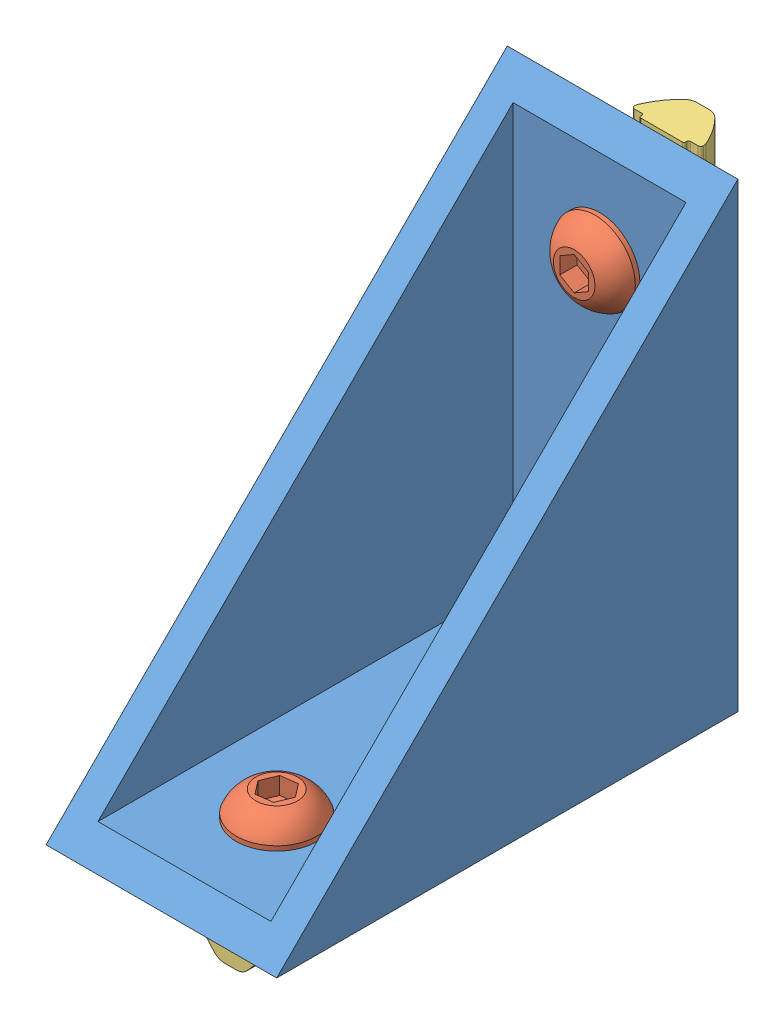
SolidWorks assembly P006955.sldasm, configuration Standard (file format 12000). Lengths in mm.
Overall size (40 94.3 93.97).
9 component instances, 3 part files, 19 mates.
Components (placement in the parent):
- P000483-1: P000483.SLDPRT [Standard] at origin size (40 80 80)
- P003249-1: P003249.SLDPRT [Standard] at (0 4 20) x (-0.982039 0 -0.188679) z (0 1 0) size (14 14 18.6)
- P003249-2: P003249.SLDPRT [Standard] at (0 20 4) size (14 14 18.6)
- P003249-3: P003249.SLDPRT [Standard] at (0 60 4) size (14 14 18.6)
- P003249-4: P003249.SLDPRT [Standard] at (0 4 60) x (0.790852 0 -0.612007) z (0 1 0) size (14 14 18.6)
- P005840-1: P005840.sldprt [Default] at (0 74 -6.7587) x (1 0 0) z (0 -1 0) size (12 7.21 22)
- P005840-2: P005840.sldprt [Default] at (0 34 -6.7587) x (1 0 0) z (0 -1 0) size (12 7.21 22)
- P005840-3: P005840.sldprt [Default] at (0 -7.0959 6) size (12 7.21 22)
- P005840-4: P005840.sldprt [Default] at (0 -7.0959 46) size (12 7.21 22)
Mates (geometry in assembly coordinates):
- Deckungsgleich4: coordinate: point of P000483-1
- Konzentrisch2: concentric aligned: cylinder of P000483-1 through (0 30 60) axis (0 -1 0) radius 4.1; cylinder of P003249-4 through (0 -2.8166 60) axis (0 -1 0) radius 4
- Deckungsgleich5: coincident anti-aligned: plane of P000483-1 through (-15 4 91.8468) normal (0 1 0); plane of P003249-4 through (-4.5079 4 63.4884) normal (0 -1 0)
- Konzentrisch3: concentric aligned: cylinder of P000483-1 through (0 30 20) axis (0 -1 0) radius 4.1; cylinder of P003249-1 through (0 -2.8166 20) axis (0 -1 0) radius 4
- Deckungsgleich8: coincident anti-aligned: plane of P000483-1 through (-15 4 91.8468) normal (0 1 0); circle of P003249-1
- Konzentrisch4: concentric aligned: cylinder of P000483-1 through (0 20 30) axis (0 0 -1) radius 4.1; cylinder of P003249-2 through (0 20 -2.8166) axis (0 0 -1) radius 4
- Konzentrisch5: concentric aligned: circle of P000483-1; cylinder of P003249-3 through (0 60 -2.8166) axis (0 0 -1) radius 4
- Deckungsgleich9: coincident anti-aligned: plane of P000483-1 through (-15 84.9571 4) normal (0 0 1); plane of P003249-3 through (-5.7 60 4) normal (0 0 -1)
- Deckungsgleich12: coincident anti-aligned: plane of P000483-1 through (-15 84.9571 4) normal (0 0 1); plane of P003249-2 through (-5.7 20 4) normal (0 0 -1)
- Konzentrisch6: concentric anti-aligned: cylinder of P003249-3 through (0 60 -2.8166) axis (0 0 -1) radius 4; cylinder of P005840-1 through (0 60 -6.7587) axis (0 0 1) radius 3.4
- Parallel3: parallel aligned: plane of P000483-1 through (20 0 0) normal (1 0 0); plane of P005840-1 through (3.9 52 -6.7587) normal (1 0 0)
- Konzentrisch7: concentric anti-aligned: cylinder of P003249-2 through (0 20 -2.8166) axis (0 0 -1) radius 4; cylinder of P005840-2 through (0 20 -6.7587) axis (0 0 1) radius 3.4
- Parallel4: parallel aligned: plane of P000483-1 through (20 0 0) normal (1 0 0); plane of P005840-2 through (3.9 12 -6.7587) normal (1 0 0)
- Konzentrisch8: concentric anti-aligned: cylinder of P003249-4 through (0 -2.8166 60) axis (0 -1 0) radius 4; cylinder of P005840-4 through (0 -7.0959 60) axis (0 1 0) radius 3.4
- Parallel5: parallel aligned: plane of P000483-1 through (20 0 0) normal (1 0 0); plane of P005840-4 through (3.9 -7.0959 68) normal (1 0 0)
- Konzentrisch9: concentric anti-aligned: cylinder of P003249-1 through (0 -2.8166 20) axis (0 -1 0) radius 4; cylinder of P005840-3 through (0 -7.0959 20) axis (0 1 0) radius 3.4
- Parallel6: parallel aligned: plane of P000483-1 through (20 0 0) normal (1 0 0); plane of P005840-3 through (3.9 -7.0959 28) normal (1 0 0)
- Deckungsgleich17: coincident: line of P005840-3 through (3.6 -7.0959 28) axis (-1 0 0); plane of P005840-4 through (3.9 -7.0959 68) normal (0 1 0)
- Deckungsgleich18: coincident aligned: plane of P005840-1 through (3.9 52 -6.7587) normal (0 0 1); plane of P005840-2 through (3.9 12 -6.7587) normal (0 0 1)
